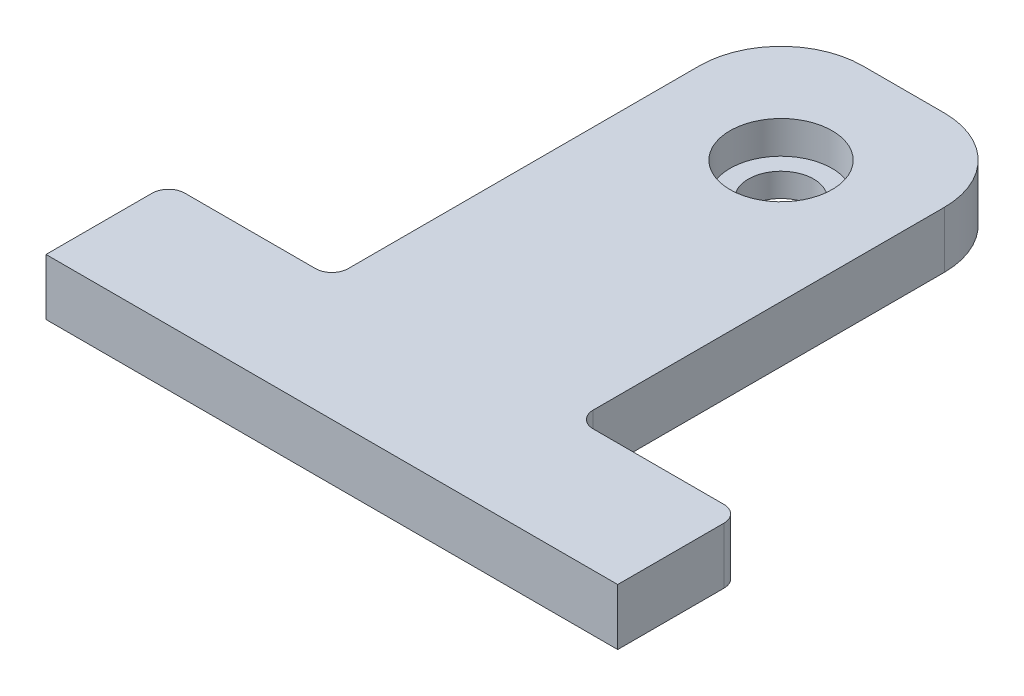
from build123d import *

# Parameters (mm, degrees)
SKETCH1_R           = 5.08
BOSS_EXTRUDE1_DEPTH = 8.763
SKETCH2_R           = 7.9375
CUT_EXTRUDE1_DEPTH  = 5.08


with BuildPart() as part:
    # Sketch1 → Boss-Extrude1 (new body)
    with BuildSketch(Plane(origin=(0, 0, 0), x_dir=(1, 0, 0), z_dir=(0, 1, 0))):
        with BuildLine():
            Line((0, 0), (88.9, 0))
            Line((88.9, 0), (88.9, 16.51))
            ThreePointArc((88.9, 16.51), (88.156051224, 18.306051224), (86.36, 19.05))
            Line((86.36, 19.05), (66.04, 19.05))
            ThreePointArc((66.04, 19.05), (64.243948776, 19.793948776), (63.5, 21.59))
            Line((63.5, 21.59), (63.5, 76.2))
            ThreePointArc((63.5, 76.2), (59.780256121, 85.180256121), (50.8, 88.9))
            Line((50.8, 88.9), (38.1, 88.9))
            ThreePointArc((38.1, 88.9), (29.119743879, 85.180256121), (25.4, 76.2))
            Line((25.4, 76.2), (25.4, 21.59))
            ThreePointArc((25.4, 21.59), (24.656051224, 19.793948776), (22.86, 19.05))
            Line((22.86, 19.05), (2.54, 19.05))
            ThreePointArc((2.54, 19.05), (0.743948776, 18.306051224), (0, 16.51))
            Line((0, 16.51), (0, 0))
        make_face()
        with Locations(Location((44.45, 69.85, 0), (0, 0, 270))):
            Circle(SKETCH1_R, mode=Mode.SUBTRACT)
    extrude(amount=BOSS_EXTRUDE1_DEPTH)

    # Sketch2 → Cut-Extrude1 (cut)
    with BuildSketch(Plane(origin=(0, 8.763, 0), x_dir=(1, 0, 0), z_dir=(0, 1, 0))):
        with Locations(Location((44.45, 69.85, 0), (0, 0, 270))):
            Circle(SKETCH2_R)
    extrude(amount=-CUT_EXTRUDE1_DEPTH, mode=Mode.SUBTRACT)


solid = part.part
